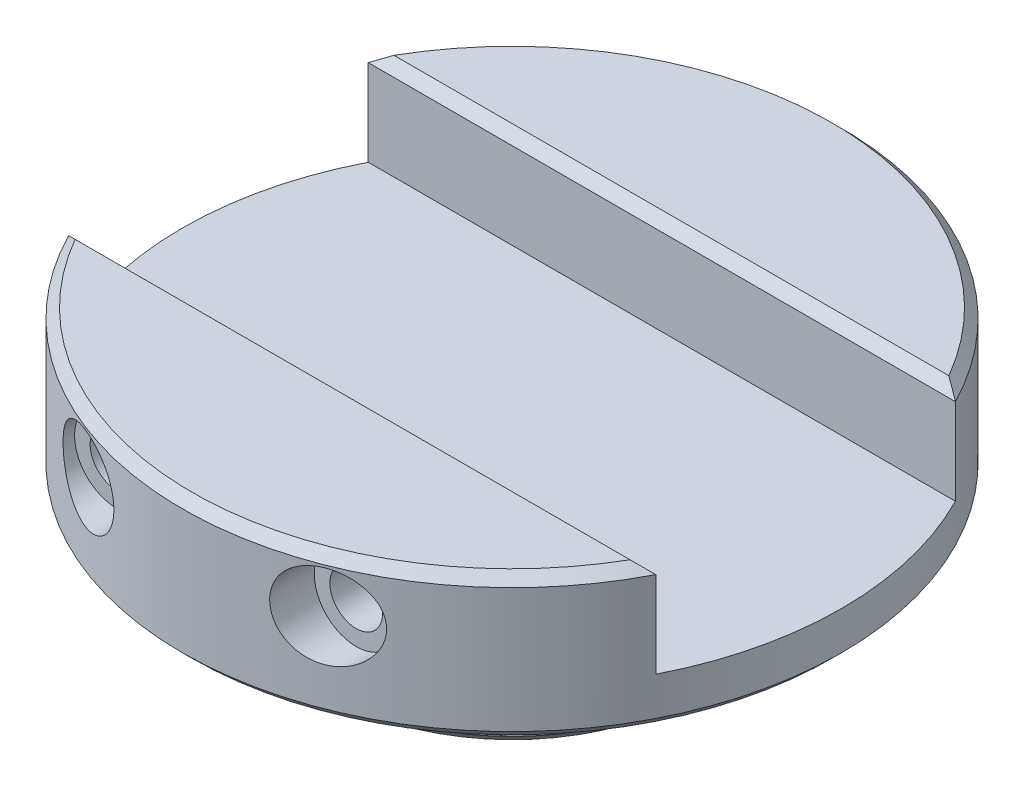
from build123d import *

# Parameters (mm, degrees)
SKETCH2_R               = 43.65625
BASE_EXTRUDE_DEPTH      = 19.05
SKETCH4_R               = 25.3619
BOSS_EXTRUDE1_DEPTH     = 13.49375
CUT_EXTRUDE1_DEPTH      = 65.611445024
CUT_EXTRUDE1_DEPTH_BACK = 65.611445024
SKETCH5_W               = 39.6875
SKETCH5_H               = 12.7
SKETCH8_R               = 5.55625
CUT_EXTRUDE3_DEPTH      = 94.251268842
CUT_EXTRUDE2_REACH      = 95.251
SKETCH7_R               = 3.4925
LPATTERN1_COUNT         = 2
LPATTERN1_PITCH         = 31.75
CHAMFER1_SIZE           = 1.27
CHAMFER2_SIZE           = 1.27


with BuildPart() as part:
    # Sketch2 → Base-Extrude (new body)
    with BuildSketch(Plane(origin=(0, 0, 0), x_dir=(1, 0, 0), z_dir=(0, 1, 0))):
        with Locations(Location((0, 0, 0), (0, 0, 90))):
            Circle(SKETCH2_R)
    extrude(amount=BASE_EXTRUDE_DEPTH)

    # Sketch4 → Boss-Extrude1 (add)
    with BuildSketch(Plane.XZ):
        with Locations(Location((0, 0, 0), (0, 0, 90))):
            Circle(SKETCH4_R)
    extrude(amount=BOSS_EXTRUDE1_DEPTH)

    # Sketch5 → Cut-Extrude1 (cut, two sides: drawn at the far end of the back side and taken through both)
    with BuildSketch(Plane(origin=(0, 0, 0), x_dir=(0, 0, -1), z_dir=(1, 0, 0)).offset(-CUT_EXTRUDE1_DEPTH_BACK)):
        with Locations((0, 12.7)):
            Rectangle(SKETCH5_W, SKETCH5_H)
    extrude(amount=CUT_EXTRUDE1_DEPTH + CUT_EXTRUDE1_DEPTH_BACK, mode=Mode.SUBTRACT)

    # Sketch8 → Cut-Extrude3 (cut, through all)
    with BuildSketch(Plane.XY.offset(36.5125)):
        with Locations(Location((-15.875, 11.90625, 0), (0, 0, 180))):
            Circle(SKETCH8_R)
    cut_extrude3 = extrude(amount=CUT_EXTRUDE3_DEPTH, mode=Mode.SUBTRACT)

    # Sketch7 → Cut-Extrude2 (cut, up to next)
    with BuildSketch(Plane.XY.offset(36.5125), mode=Mode.PRIVATE) as cut_extrude2_sk1:
        with Locations((-15.875, 11.90625)):
            Circle(SKETCH7_R)
    cut_extrude2_tool1 = extrude(cut_extrude2_sk1.sketch, amount=-CUT_EXTRUDE2_REACH, mode=Mode.PRIVATE) & part.part
    cut_extrude2 = cut_extrude2_tool1.solids().sort_by_distance((-15.875, 11.90625, 36.5125))[0]
    add(cut_extrude2, mode=Mode.SUBTRACT)

    # LPattern1: Cut-Extrude3, Cut-Extrude2 ×2
    with Locations(*[(i * LPATTERN1_PITCH, 0, 0) for i in range(1, LPATTERN1_COUNT)]):
        add(cut_extrude3, mode=Mode.SUBTRACT)
        add(cut_extrude2, mode=Mode.SUBTRACT)

    # Chamfer1
    chamfer1_edges = [part.edges().sort_by_distance(p)[0] for p in [
        (0, -13.49375, -25.3619),
    ]]
    chamfer(chamfer1_edges, length=CHAMFER1_SIZE)

    # Chamfer2
    chamfer2_edges = [part.edges().sort_by_distance(p)[0] for p in [
        (0, 19.05, 43.65625),
        (0, 19.05, -19.84375),
        (0, 19.05, 19.84375),
        (0, 0, 43.65625),
        (22.798733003, 19.05, -37.230175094),
    ]]
    chamfer(chamfer2_edges, length=CHAMFER2_SIZE)


solid = part.part
